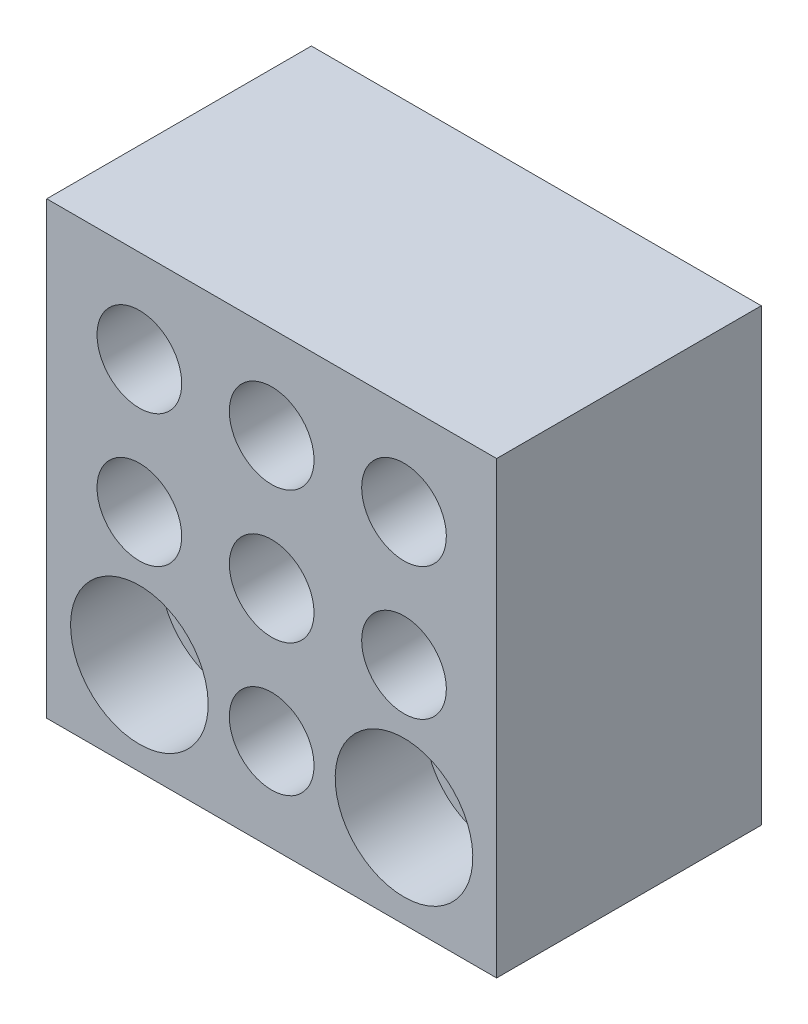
ISO-10303-21;
HEADER;
FILE_DESCRIPTION(('STEP AP214'),'2;1');
FILE_NAME('part.step','',(''),(''),'','','');
FILE_SCHEMA(('AUTOMOTIVE_DESIGN { 1 0 10303 214 1 1 1 1 }'));
ENDSEC;
DATA;
#1=APPLICATION_CONTEXT('core data for automotive mechanical design processes');
#2=APPLICATION_PROTOCOL_DEFINITION('international standard','automotive_design',2000,#1);
#3=PRODUCT_CONTEXT('',#1,'mechanical');
#4=PRODUCT('Part','Part','',(#3));
#5=PRODUCT_RELATED_PRODUCT_CATEGORY('part','',(#4));
#6=PRODUCT_DEFINITION_FORMATION('','',#4);
#7=PRODUCT_DEFINITION_CONTEXT('part definition',#1,'design');
#8=PRODUCT_DEFINITION('design','',#6,#7);
#9=PRODUCT_DEFINITION_SHAPE('','',#8);
#10=(LENGTH_UNIT() NAMED_UNIT(*) SI_UNIT(.MILLI.,.METRE.));
#11=(NAMED_UNIT(*) PLANE_ANGLE_UNIT() SI_UNIT($,.RADIAN.));
#12=(NAMED_UNIT(*) SI_UNIT($,.STERADIAN.) SOLID_ANGLE_UNIT());
#13=UNCERTAINTY_MEASURE_WITH_UNIT(LENGTH_MEASURE(1.E-05),#10,'distance_accuracy_value','');
#14=(GEOMETRIC_REPRESENTATION_CONTEXT(3) GLOBAL_UNCERTAINTY_ASSIGNED_CONTEXT((#13)) GLOBAL_UNIT_ASSIGNED_CONTEXT((#10,
#11,#12)) REPRESENTATION_CONTEXT('',''));
#15=CARTESIAN_POINT('',(0.,0.,0.));
#16=DIRECTION('',(0.,0.,1.));
#17=DIRECTION('',(1.,0.,0.));
#18=AXIS2_PLACEMENT_3D('',#15,#16,#17);
#19=CARTESIAN_POINT('',(25.,0.,50.));
#20=DIRECTION('',(0.,0.,-1.));
#21=DIRECTION('',(0.,1.,0.));
#22=AXIS2_PLACEMENT_3D('',#19,#20,#21);
#23=CYLINDRICAL_SURFACE('',#22,8.);
#24=CARTESIAN_POINT('',(25.,0.,50.));
#25=DIRECTION('',(0.,0.,1.));
#26=DIRECTION('',(0.,-1.,0.));
#27=AXIS2_PLACEMENT_3D('',#24,#25,#26);
#28=CIRCLE('',#27,8.);
#29=CARTESIAN_POINT('',(25.,-8.,50.));
#30=VERTEX_POINT('',#29);
#31=EDGE_CURVE('E72',#30,#30,#28,.T.);
#32=ORIENTED_EDGE('',*,*,#31,.T.);
#33=EDGE_LOOP('',(#32));
#34=FACE_BOUND('',#33,.T.);
#35=CARTESIAN_POINT('',(25.,0.,15.));
#36=DIRECTION('',(0.,0.,-1.));
#37=DIRECTION('',(-1.,0.,0.));
#38=AXIS2_PLACEMENT_3D('',#35,#36,#37);
#39=CIRCLE('',#38,8.);
#40=CARTESIAN_POINT('',(17.,0.,15.));
#41=VERTEX_POINT('',#40);
#42=EDGE_CURVE('E187',#41,#41,#39,.T.);
#43=ORIENTED_EDGE('',*,*,#42,.T.);
#44=EDGE_LOOP('',(#43));
#45=FACE_BOUND('',#44,.T.);
#46=ADVANCED_FACE('F14',(#34,#45),#23,.F.);
#47=CARTESIAN_POINT('',(0.,25.,50.));
#48=DIRECTION('',(0.,0.,-1.));
#49=DIRECTION('',(0.,1.,0.));
#50=AXIS2_PLACEMENT_3D('',#47,#48,#49);
#51=CYLINDRICAL_SURFACE('',#50,8.);
#52=CARTESIAN_POINT('',(0.,25.,50.));
#53=DIRECTION('',(0.,0.,1.));
#54=DIRECTION('',(0.,-1.,0.));
#55=AXIS2_PLACEMENT_3D('',#52,#53,#54);
#56=CIRCLE('',#55,8.);
#57=CARTESIAN_POINT('',(0.,17.,50.));
#58=VERTEX_POINT('',#57);
#59=EDGE_CURVE('E93',#58,#58,#56,.T.);
#60=ORIENTED_EDGE('',*,*,#59,.T.);
#61=EDGE_LOOP('',(#60));
#62=FACE_BOUND('',#61,.T.);
#63=CARTESIAN_POINT('',(0.,25.,15.));
#64=DIRECTION('',(0.,0.,-1.));
#65=DIRECTION('',(-1.,0.,0.));
#66=AXIS2_PLACEMENT_3D('',#63,#64,#65);
#67=CIRCLE('',#66,8.);
#68=CARTESIAN_POINT('',(-8.,25.,15.));
#69=VERTEX_POINT('',#68);
#70=EDGE_CURVE('E178',#69,#69,#67,.T.);
#71=ORIENTED_EDGE('',*,*,#70,.T.);
#72=EDGE_LOOP('',(#71));
#73=FACE_BOUND('',#72,.T.);
#74=ADVANCED_FACE('F223',(#62,#73),#51,.F.);
#75=CARTESIAN_POINT('',(25.,25.,50.));
#76=DIRECTION('',(0.,0.,-1.));
#77=DIRECTION('',(0.,1.,0.));
#78=AXIS2_PLACEMENT_3D('',#75,#76,#77);
#79=CYLINDRICAL_SURFACE('',#78,8.);
#80=CARTESIAN_POINT('',(25.,25.,50.));
#81=DIRECTION('',(0.,0.,1.));
#82=DIRECTION('',(0.,-1.,0.));
#83=AXIS2_PLACEMENT_3D('',#80,#81,#82);
#84=CIRCLE('',#83,8.);
#85=CARTESIAN_POINT('',(25.,17.,50.));
#86=VERTEX_POINT('',#85);
#87=EDGE_CURVE('E102',#86,#86,#84,.T.);
#88=ORIENTED_EDGE('',*,*,#87,.T.);
#89=EDGE_LOOP('',(#88));
#90=FACE_BOUND('',#89,.T.);
#91=CARTESIAN_POINT('',(25.,25.,15.));
#92=DIRECTION('',(0.,0.,-1.));
#93=DIRECTION('',(-1.,0.,0.));
#94=AXIS2_PLACEMENT_3D('',#91,#92,#93);
#95=CIRCLE('',#94,8.);
#96=CARTESIAN_POINT('',(17.,25.,15.));
#97=VERTEX_POINT('',#96);
#98=EDGE_CURVE('E169',#97,#97,#95,.T.);
#99=ORIENTED_EDGE('',*,*,#98,.T.);
#100=EDGE_LOOP('',(#99));
#101=FACE_BOUND('',#100,.T.);
#102=ADVANCED_FACE('F228',(#90,#101),#79,.F.);
#103=CARTESIAN_POINT('',(50.,25.,50.));
#104=DIRECTION('',(0.,0.,-1.));
#105=DIRECTION('',(0.,1.,0.));
#106=AXIS2_PLACEMENT_3D('',#103,#104,#105);
#107=CYLINDRICAL_SURFACE('',#106,8.);
#108=CARTESIAN_POINT('',(50.,25.,50.));
#109=DIRECTION('',(0.,0.,1.));
#110=DIRECTION('',(0.,-1.,0.));
#111=AXIS2_PLACEMENT_3D('',#108,#109,#110);
#112=CIRCLE('',#111,8.);
#113=CARTESIAN_POINT('',(50.,17.,50.));
#114=VERTEX_POINT('',#113);
#115=EDGE_CURVE('E108',#114,#114,#112,.T.);
#116=ORIENTED_EDGE('',*,*,#115,.T.);
#117=EDGE_LOOP('',(#116));
#118=FACE_BOUND('',#117,.T.);
#119=CARTESIAN_POINT('',(50.,25.,15.));
#120=DIRECTION('',(0.,0.,-1.));
#121=DIRECTION('',(-1.,0.,0.));
#122=AXIS2_PLACEMENT_3D('',#119,#120,#121);
#123=CIRCLE('',#122,8.);
#124=CARTESIAN_POINT('',(42.,25.,15.));
#125=VERTEX_POINT('',#124);
#126=EDGE_CURVE('E160',#125,#125,#123,.T.);
#127=ORIENTED_EDGE('',*,*,#126,.T.);
#128=EDGE_LOOP('',(#127));
#129=FACE_BOUND('',#128,.T.);
#130=ADVANCED_FACE('F243',(#118,#129),#107,.F.);
#131=CARTESIAN_POINT('',(50.,50.,50.));
#132=DIRECTION('',(0.,0.,-1.));
#133=DIRECTION('',(0.,1.,0.));
#134=AXIS2_PLACEMENT_3D('',#131,#132,#133);
#135=CYLINDRICAL_SURFACE('',#134,8.);
#136=CARTESIAN_POINT('',(50.,50.,50.));
#137=DIRECTION('',(0.,0.,1.));
#138=DIRECTION('',(0.,-1.,0.));
#139=AXIS2_PLACEMENT_3D('',#136,#137,#138);
#140=CIRCLE('',#139,8.);
#141=CARTESIAN_POINT('',(50.,42.,50.));
#142=VERTEX_POINT('',#141);
#143=EDGE_CURVE('E105',#142,#142,#140,.T.);
#144=ORIENTED_EDGE('',*,*,#143,.T.);
#145=EDGE_LOOP('',(#144));
#146=FACE_BOUND('',#145,.T.);
#147=CARTESIAN_POINT('',(50.,50.,15.));
#148=DIRECTION('',(0.,0.,-1.));
#149=DIRECTION('',(-1.,0.,0.));
#150=AXIS2_PLACEMENT_3D('',#147,#148,#149);
#151=CIRCLE('',#150,8.);
#152=CARTESIAN_POINT('',(42.,50.,15.));
#153=VERTEX_POINT('',#152);
#154=EDGE_CURVE('E151',#153,#153,#151,.T.);
#155=ORIENTED_EDGE('',*,*,#154,.T.);
#156=EDGE_LOOP('',(#155));
#157=FACE_BOUND('',#156,.T.);
#158=ADVANCED_FACE('F239',(#146,#157),#135,.F.);
#159=CARTESIAN_POINT('',(25.,50.,50.));
#160=DIRECTION('',(0.,0.,-1.));
#161=DIRECTION('',(0.,1.,0.));
#162=AXIS2_PLACEMENT_3D('',#159,#160,#161);
#163=CYLINDRICAL_SURFACE('',#162,8.);
#164=CARTESIAN_POINT('',(25.,50.,50.));
#165=DIRECTION('',(0.,0.,1.));
#166=DIRECTION('',(0.,-1.,0.));
#167=AXIS2_PLACEMENT_3D('',#164,#165,#166);
#168=CIRCLE('',#167,8.);
#169=CARTESIAN_POINT('',(25.,42.,50.));
#170=VERTEX_POINT('',#169);
#171=EDGE_CURVE('E99',#170,#170,#168,.T.);
#172=ORIENTED_EDGE('',*,*,#171,.T.);
#173=EDGE_LOOP('',(#172));
#174=FACE_BOUND('',#173,.T.);
#175=CARTESIAN_POINT('',(25.,50.,15.));
#176=DIRECTION('',(0.,0.,-1.));
#177=DIRECTION('',(-1.,0.,0.));
#178=AXIS2_PLACEMENT_3D('',#175,#176,#177);
#179=CIRCLE('',#178,8.);
#180=CARTESIAN_POINT('',(17.,50.,15.));
#181=VERTEX_POINT('',#180);
#182=EDGE_CURVE('E142',#181,#181,#179,.T.);
#183=ORIENTED_EDGE('',*,*,#182,.T.);
#184=EDGE_LOOP('',(#183));
#185=FACE_BOUND('',#184,.T.);
#186=ADVANCED_FACE('F235',(#174,#185),#163,.F.);
#187=CARTESIAN_POINT('',(0.,50.,50.));
#188=DIRECTION('',(0.,0.,-1.));
#189=DIRECTION('',(0.,1.,0.));
#190=AXIS2_PLACEMENT_3D('',#187,#188,#189);
#191=CYLINDRICAL_SURFACE('',#190,8.);
#192=CARTESIAN_POINT('',(0.,50.,50.));
#193=DIRECTION('',(0.,0.,1.));
#194=DIRECTION('',(0.,-1.,0.));
#195=AXIS2_PLACEMENT_3D('',#192,#193,#194);
#196=CIRCLE('',#195,8.);
#197=CARTESIAN_POINT('',(0.,42.,50.));
#198=VERTEX_POINT('',#197);
#199=EDGE_CURVE('E96',#198,#198,#196,.T.);
#200=ORIENTED_EDGE('',*,*,#199,.T.);
#201=EDGE_LOOP('',(#200));
#202=FACE_BOUND('',#201,.T.);
#203=CARTESIAN_POINT('',(0.,50.,15.));
#204=DIRECTION('',(0.,0.,-1.));
#205=DIRECTION('',(-1.,0.,0.));
#206=AXIS2_PLACEMENT_3D('',#203,#204,#205);
#207=CIRCLE('',#206,8.);
#208=CARTESIAN_POINT('',(-8.,50.,15.));
#209=VERTEX_POINT('',#208);
#210=EDGE_CURVE('E135',#209,#209,#207,.T.);
#211=ORIENTED_EDGE('',*,*,#210,.T.);
#212=EDGE_LOOP('',(#211));
#213=FACE_BOUND('',#212,.T.);
#214=ADVANCED_FACE('F218',(#202,#213),#191,.F.);
#215=CARTESIAN_POINT('',(-17.5,-17.5,50.));
#216=DIRECTION('',(0.,0.,-1.));
#217=DIRECTION('',(0.,1.,0.));
#218=AXIS2_PLACEMENT_3D('',#215,#216,#217);
#219=PLANE('',#218);
#220=CARTESIAN_POINT('',(50.,0.,50.));
#221=DIRECTION('',(0.,0.,1.));
#222=DIRECTION('',(0.,-1.,0.));
#223=AXIS2_PLACEMENT_3D('',#220,#221,#222);
#224=CIRCLE('',#223,13.);
#225=CARTESIAN_POINT('',(50.,-13.,50.));
#226=VERTEX_POINT('',#225);
#227=EDGE_CURVE('E120',#226,#226,#224,.T.);
#228=ORIENTED_EDGE('',*,*,#227,.F.);
#229=EDGE_LOOP('',(#228));
#230=FACE_BOUND('',#229,.T.);
#231=ORIENTED_EDGE('',*,*,#143,.F.);
#232=EDGE_LOOP('',(#231));
#233=FACE_BOUND('',#232,.T.);
#234=ORIENTED_EDGE('',*,*,#171,.F.);
#235=EDGE_LOOP('',(#234));
#236=FACE_BOUND('',#235,.T.);
#237=ORIENTED_EDGE('',*,*,#59,.F.);
#238=EDGE_LOOP('',(#237));
#239=FACE_BOUND('',#238,.T.);
#240=DIRECTION('',(-1.,0.,0.));
#241=VECTOR('',#240,1.);
#242=CARTESIAN_POINT('',(67.5,-17.5,50.));
#243=LINE('',#242,#241);
#244=CARTESIAN_POINT('',(67.5,-17.5,50.));
#245=VERTEX_POINT('',#244);
#246=CARTESIAN_POINT('',(-17.5,-17.5,50.));
#247=VERTEX_POINT('',#246);
#248=EDGE_CURVE('E56',#245,#247,#243,.T.);
#249=ORIENTED_EDGE('',*,*,#248,.F.);
#250=DIRECTION('',(0.,-1.,0.));
#251=VECTOR('',#250,1.);
#252=CARTESIAN_POINT('',(67.5,67.5,50.));
#253=LINE('',#252,#251);
#254=CARTESIAN_POINT('',(67.5,67.5,50.));
#255=VERTEX_POINT('',#254);
#256=EDGE_CURVE('E62',#255,#245,#253,.T.);
#257=ORIENTED_EDGE('',*,*,#256,.F.);
#258=DIRECTION('',(1.,0.,0.));
#259=VECTOR('',#258,1.);
#260=CARTESIAN_POINT('',(-17.5,67.5,50.));
#261=LINE('',#260,#259);
#262=CARTESIAN_POINT('',(-17.5,67.5,50.));
#263=VERTEX_POINT('',#262);
#264=EDGE_CURVE('E81',#263,#255,#261,.T.);
#265=ORIENTED_EDGE('',*,*,#264,.F.);
#266=DIRECTION('',(0.,1.,0.));
#267=VECTOR('',#266,1.);
#268=CARTESIAN_POINT('',(-17.5,-17.5,50.));
#269=LINE('',#268,#267);
#270=EDGE_CURVE('E83',#247,#263,#269,.T.);
#271=ORIENTED_EDGE('',*,*,#270,.F.);
#272=EDGE_LOOP('',(#249,#257,#265,#271));
#273=FACE_BOUND('',#272,.T.);
#274=ORIENTED_EDGE('',*,*,#31,.F.);
#275=EDGE_LOOP('',(#274));
#276=FACE_BOUND('',#275,.T.);
#277=ORIENTED_EDGE('',*,*,#199,.F.);
#278=EDGE_LOOP('',(#277));
#279=FACE_BOUND('',#278,.T.);
#280=ORIENTED_EDGE('',*,*,#87,.F.);
#281=EDGE_LOOP('',(#280));
#282=FACE_BOUND('',#281,.T.);
#283=ORIENTED_EDGE('',*,*,#115,.F.);
#284=EDGE_LOOP('',(#283));
#285=FACE_BOUND('',#284,.T.);
#286=CARTESIAN_POINT('',(0.,0.,50.));
#287=DIRECTION('',(0.,0.,1.));
#288=DIRECTION('',(0.,-1.,0.));
#289=AXIS2_PLACEMENT_3D('',#286,#287,#288);
#290=CIRCLE('',#289,13.);
#291=CARTESIAN_POINT('',(0.,-13.,50.));
#292=VERTEX_POINT('',#291);
#293=EDGE_CURVE('E132',#292,#292,#290,.T.);
#294=ORIENTED_EDGE('',*,*,#293,.F.);
#295=EDGE_LOOP('',(#294));
#296=FACE_BOUND('',#295,.T.);
#297=ADVANCED_FACE('F209',(#230,#233,#236,#239,#273,#276,#279,#282,#285,#296),#219,.F.);
#298=CARTESIAN_POINT('',(-17.5,-17.5,0.));
#299=DIRECTION('',(0.,0.,-1.));
#300=DIRECTION('',(0.,1.,0.));
#301=AXIS2_PLACEMENT_3D('',#298,#299,#300);
#302=PLANE('',#301);
#303=CARTESIAN_POINT('',(50.,0.,0.));
#304=DIRECTION('',(0.,0.,1.));
#305=DIRECTION('',(0.,-1.,0.));
#306=AXIS2_PLACEMENT_3D('',#303,#304,#305);
#307=CIRCLE('',#306,9.);
#308=CARTESIAN_POINT('',(50.,-9.,0.));
#309=VERTEX_POINT('',#308);
#310=EDGE_CURVE('E111',#309,#309,#307,.T.);
#311=ORIENTED_EDGE('',*,*,#310,.T.);
#312=EDGE_LOOP('',(#311));
#313=FACE_BOUND('',#312,.T.);
#314=DIRECTION('',(-1.,0.,0.));
#315=VECTOR('',#314,1.);
#316=CARTESIAN_POINT('',(67.5,-17.5,0.));
#317=LINE('',#316,#315);
#318=CARTESIAN_POINT('',(67.5,-17.5,0.));
#319=VERTEX_POINT('',#318);
#320=CARTESIAN_POINT('',(-17.5,-17.5,0.));
#321=VERTEX_POINT('',#320);
#322=EDGE_CURVE('E54',#319,#321,#317,.T.);
#323=ORIENTED_EDGE('',*,*,#322,.T.);
#324=DIRECTION('',(0.,1.,0.));
#325=VECTOR('',#324,1.);
#326=CARTESIAN_POINT('',(-17.5,-17.5,0.));
#327=LINE('',#326,#325);
#328=CARTESIAN_POINT('',(-17.5,67.5,0.));
#329=VERTEX_POINT('',#328);
#330=EDGE_CURVE('E69',#321,#329,#327,.T.);
#331=ORIENTED_EDGE('',*,*,#330,.T.);
#332=DIRECTION('',(1.,0.,0.));
#333=VECTOR('',#332,1.);
#334=CARTESIAN_POINT('',(-17.5,67.5,0.));
#335=LINE('',#334,#333);
#336=CARTESIAN_POINT('',(67.5,67.5,0.));
#337=VERTEX_POINT('',#336);
#338=EDGE_CURVE('E75',#329,#337,#335,.T.);
#339=ORIENTED_EDGE('',*,*,#338,.T.);
#340=DIRECTION('',(0.,-1.,0.));
#341=VECTOR('',#340,1.);
#342=CARTESIAN_POINT('',(67.5,67.5,0.));
#343=LINE('',#342,#341);
#344=EDGE_CURVE('E71',#337,#319,#343,.T.);
#345=ORIENTED_EDGE('',*,*,#344,.T.);
#346=EDGE_LOOP('',(#323,#331,#339,#345));
#347=FACE_BOUND('',#346,.T.);
#348=CARTESIAN_POINT('',(0.,0.,0.));
#349=DIRECTION('',(0.,0.,1.));
#350=DIRECTION('',(0.,-1.,0.));
#351=AXIS2_PLACEMENT_3D('',#348,#349,#350);
#352=CIRCLE('',#351,9.);
#353=CARTESIAN_POINT('',(0.,-9.,0.));
#354=VERTEX_POINT('',#353);
#355=EDGE_CURVE('E123',#354,#354,#352,.T.);
#356=ORIENTED_EDGE('',*,*,#355,.T.);
#357=EDGE_LOOP('',(#356));
#358=FACE_BOUND('',#357,.T.);
#359=CARTESIAN_POINT('',(0.,50.,0.));
#360=DIRECTION('',(0.,0.,-1.));
#361=DIRECTION('',(-1.,0.,0.));
#362=AXIS2_PLACEMENT_3D('',#359,#360,#361);
#363=CIRCLE('',#362,6.9);
#364=CARTESIAN_POINT('',(-6.9,50.,0.));
#365=VERTEX_POINT('',#364);
#366=EDGE_CURVE('E139',#365,#365,#363,.T.);
#367=ORIENTED_EDGE('',*,*,#366,.F.);
#368=EDGE_LOOP('',(#367));
#369=FACE_BOUND('',#368,.T.);
#370=CARTESIAN_POINT('',(25.,50.,0.));
#371=DIRECTION('',(0.,0.,-1.));
#372=DIRECTION('',(-1.,0.,0.));
#373=AXIS2_PLACEMENT_3D('',#370,#371,#372);
#374=CIRCLE('',#373,6.9);
#375=CARTESIAN_POINT('',(18.1,50.,0.));
#376=VERTEX_POINT('',#375);
#377=EDGE_CURVE('E148',#376,#376,#374,.T.);
#378=ORIENTED_EDGE('',*,*,#377,.F.);
#379=EDGE_LOOP('',(#378));
#380=FACE_BOUND('',#379,.T.);
#381=CARTESIAN_POINT('',(50.,50.,0.));
#382=DIRECTION('',(0.,0.,-1.));
#383=DIRECTION('',(-1.,0.,0.));
#384=AXIS2_PLACEMENT_3D('',#381,#382,#383);
#385=CIRCLE('',#384,6.9);
#386=CARTESIAN_POINT('',(43.1,50.,0.));
#387=VERTEX_POINT('',#386);
#388=EDGE_CURVE('E157',#387,#387,#385,.T.);
#389=ORIENTED_EDGE('',*,*,#388,.F.);
#390=EDGE_LOOP('',(#389));
#391=FACE_BOUND('',#390,.T.);
#392=CARTESIAN_POINT('',(50.,25.,0.));
#393=DIRECTION('',(0.,0.,-1.));
#394=DIRECTION('',(-1.,0.,0.));
#395=AXIS2_PLACEMENT_3D('',#392,#393,#394);
#396=CIRCLE('',#395,6.9);
#397=CARTESIAN_POINT('',(43.1,25.,0.));
#398=VERTEX_POINT('',#397);
#399=EDGE_CURVE('E166',#398,#398,#396,.T.);
#400=ORIENTED_EDGE('',*,*,#399,.F.);
#401=EDGE_LOOP('',(#400));
#402=FACE_BOUND('',#401,.T.);
#403=CARTESIAN_POINT('',(25.,25.,0.));
#404=DIRECTION('',(0.,0.,-1.));
#405=DIRECTION('',(-1.,0.,0.));
#406=AXIS2_PLACEMENT_3D('',#403,#404,#405);
#407=CIRCLE('',#406,6.9);
#408=CARTESIAN_POINT('',(18.1,25.,0.));
#409=VERTEX_POINT('',#408);
#410=EDGE_CURVE('E175',#409,#409,#407,.T.);
#411=ORIENTED_EDGE('',*,*,#410,.F.);
#412=EDGE_LOOP('',(#411));
#413=FACE_BOUND('',#412,.T.);
#414=CARTESIAN_POINT('',(0.,25.,0.));
#415=DIRECTION('',(0.,0.,-1.));
#416=DIRECTION('',(-1.,0.,0.));
#417=AXIS2_PLACEMENT_3D('',#414,#415,#416);
#418=CIRCLE('',#417,6.9);
#419=CARTESIAN_POINT('',(-6.9,25.,0.));
#420=VERTEX_POINT('',#419);
#421=EDGE_CURVE('E184',#420,#420,#418,.T.);
#422=ORIENTED_EDGE('',*,*,#421,.F.);
#423=EDGE_LOOP('',(#422));
#424=FACE_BOUND('',#423,.T.);
#425=CARTESIAN_POINT('',(25.,0.,0.));
#426=DIRECTION('',(0.,0.,-1.));
#427=DIRECTION('',(-1.,0.,0.));
#428=AXIS2_PLACEMENT_3D('',#425,#426,#427);
#429=CIRCLE('',#428,6.9);
#430=CARTESIAN_POINT('',(18.1,0.,0.));
#431=VERTEX_POINT('',#430);
#432=EDGE_CURVE('E193',#431,#431,#429,.T.);
#433=ORIENTED_EDGE('',*,*,#432,.F.);
#434=EDGE_LOOP('',(#433));
#435=FACE_BOUND('',#434,.T.);
#436=ADVANCED_FACE('F66',(#313,#347,#358,#369,#380,#391,#402,#413,#424,#435),#302,.T.);
#437=CARTESIAN_POINT('',(67.5,-17.5,50.));
#438=DIRECTION('',(0.,-1.,0.));
#439=DIRECTION('',(1.,0.,0.));
#440=AXIS2_PLACEMENT_3D('',#437,#438,#439);
#441=PLANE('',#440);
#442=DIRECTION('',(0.,0.,-1.));
#443=VECTOR('',#442,1.);
#444=CARTESIAN_POINT('',(67.5,-17.5,50.));
#445=LINE('',#444,#443);
#446=EDGE_CURVE('E9',#245,#319,#445,.T.);
#447=ORIENTED_EDGE('',*,*,#446,.F.);
#448=ORIENTED_EDGE('',*,*,#248,.T.);
#449=DIRECTION('',(0.,0.,-1.));
#450=VECTOR('',#449,1.);
#451=CARTESIAN_POINT('',(-17.5,-17.5,50.));
#452=LINE('',#451,#450);
#453=EDGE_CURVE('E51',#247,#321,#452,.T.);
#454=ORIENTED_EDGE('',*,*,#453,.T.);
#455=ORIENTED_EDGE('',*,*,#322,.F.);
#456=EDGE_LOOP('',(#447,#448,#454,#455));
#457=FACE_BOUND('',#456,.T.);
#458=ADVANCED_FACE('F53',(#457),#441,.T.);
#459=CARTESIAN_POINT('',(67.5,67.5,50.));
#460=DIRECTION('',(1.,0.,0.));
#461=DIRECTION('',(0.,1.,0.));
#462=AXIS2_PLACEMENT_3D('',#459,#460,#461);
#463=PLANE('',#462);
#464=DIRECTION('',(0.,0.,-1.));
#465=VECTOR('',#464,1.);
#466=CARTESIAN_POINT('',(67.5,67.5,50.));
#467=LINE('',#466,#465);
#468=EDGE_CURVE('E22',#255,#337,#467,.T.);
#469=ORIENTED_EDGE('',*,*,#468,.F.);
#470=ORIENTED_EDGE('',*,*,#256,.T.);
#471=ORIENTED_EDGE('',*,*,#446,.T.);
#472=ORIENTED_EDGE('',*,*,#344,.F.);
#473=EDGE_LOOP('',(#469,#470,#471,#472));
#474=FACE_BOUND('',#473,.T.);
#475=ADVANCED_FACE('F16',(#474),#463,.T.);
#476=CARTESIAN_POINT('',(-17.5,67.5,50.));
#477=DIRECTION('',(0.,1.,0.));
#478=DIRECTION('',(-1.,0.,0.));
#479=AXIS2_PLACEMENT_3D('',#476,#477,#478);
#480=PLANE('',#479);
#481=DIRECTION('',(0.,0.,-1.));
#482=VECTOR('',#481,1.);
#483=CARTESIAN_POINT('',(-17.5,67.5,50.));
#484=LINE('',#483,#482);
#485=EDGE_CURVE('E61',#263,#329,#484,.T.);
#486=ORIENTED_EDGE('',*,*,#485,.F.);
#487=ORIENTED_EDGE('',*,*,#264,.T.);
#488=ORIENTED_EDGE('',*,*,#468,.T.);
#489=ORIENTED_EDGE('',*,*,#338,.F.);
#490=EDGE_LOOP('',(#486,#487,#488,#489));
#491=FACE_BOUND('',#490,.T.);
#492=ADVANCED_FACE('F87',(#491),#480,.T.);
#493=CARTESIAN_POINT('',(-17.5,-17.5,50.));
#494=DIRECTION('',(-1.,0.,0.));
#495=DIRECTION('',(0.,-1.,0.));
#496=AXIS2_PLACEMENT_3D('',#493,#494,#495);
#497=PLANE('',#496);
#498=ORIENTED_EDGE('',*,*,#270,.T.);
#499=ORIENTED_EDGE('',*,*,#485,.T.);
#500=ORIENTED_EDGE('',*,*,#330,.F.);
#501=ORIENTED_EDGE('',*,*,#453,.F.);
#502=EDGE_LOOP('',(#498,#499,#500,#501));
#503=FACE_BOUND('',#502,.T.);
#504=ADVANCED_FACE('F74',(#503),#497,.T.);
#505=CARTESIAN_POINT('',(50.,0.,50.));
#506=DIRECTION('',(0.,0.,1.));
#507=DIRECTION('',(0.,-1.,0.));
#508=AXIS2_PLACEMENT_3D('',#505,#506,#507);
#509=CYLINDRICAL_SURFACE('',#508,9.);
#510=CARTESIAN_POINT('',(50.,0.,33.));
#511=DIRECTION('',(0.,0.,1.));
#512=DIRECTION('',(0.,-1.,0.));
#513=AXIS2_PLACEMENT_3D('',#510,#511,#512);
#514=CIRCLE('',#513,9.);
#515=CARTESIAN_POINT('',(50.,-9.,33.));
#516=VERTEX_POINT('',#515);
#517=EDGE_CURVE('E114',#516,#516,#514,.T.);
#518=ORIENTED_EDGE('',*,*,#517,.T.);
#519=EDGE_LOOP('',(#518));
#520=FACE_BOUND('',#519,.T.);
#521=ORIENTED_EDGE('',*,*,#310,.F.);
#522=EDGE_LOOP('',(#521));
#523=FACE_BOUND('',#522,.T.);
#524=ADVANCED_FACE('F251',(#520,#523),#509,.F.);
#525=CARTESIAN_POINT('',(50.,-9.,33.));
#526=DIRECTION('',(0.,0.,1.));
#527=DIRECTION('',(0.,-1.,0.));
#528=AXIS2_PLACEMENT_3D('',#525,#526,#527);
#529=PLANE('',#528);
#530=CARTESIAN_POINT('',(50.,0.,33.));
#531=DIRECTION('',(0.,0.,1.));
#532=DIRECTION('',(0.,-1.,0.));
#533=AXIS2_PLACEMENT_3D('',#530,#531,#532);
#534=CIRCLE('',#533,13.);
#535=CARTESIAN_POINT('',(50.,-13.,33.));
#536=VERTEX_POINT('',#535);
#537=EDGE_CURVE('E117',#536,#536,#534,.T.);
#538=ORIENTED_EDGE('',*,*,#537,.T.);
#539=EDGE_LOOP('',(#538));
#540=FACE_BOUND('',#539,.T.);
#541=ORIENTED_EDGE('',*,*,#517,.F.);
#542=EDGE_LOOP('',(#541));
#543=FACE_BOUND('',#542,.T.);
#544=ADVANCED_FACE('F254',(#540,#543),#529,.T.);
#545=CARTESIAN_POINT('',(50.,0.,50.));
#546=DIRECTION('',(0.,0.,1.));
#547=DIRECTION('',(0.,-1.,0.));
#548=AXIS2_PLACEMENT_3D('',#545,#546,#547);
#549=CYLINDRICAL_SURFACE('',#548,13.);
#550=ORIENTED_EDGE('',*,*,#227,.T.);
#551=EDGE_LOOP('',(#550));
#552=FACE_BOUND('',#551,.T.);
#553=ORIENTED_EDGE('',*,*,#537,.F.);
#554=EDGE_LOOP('',(#553));
#555=FACE_BOUND('',#554,.T.);
#556=ADVANCED_FACE('F258',(#552,#555),#549,.F.);
#557=CARTESIAN_POINT('',(0.,0.,50.));
#558=DIRECTION('',(0.,0.,1.));
#559=DIRECTION('',(0.,-1.,0.));
#560=AXIS2_PLACEMENT_3D('',#557,#558,#559);
#561=CYLINDRICAL_SURFACE('',#560,9.);
#562=CARTESIAN_POINT('',(0.,0.,33.));
#563=DIRECTION('',(0.,0.,1.));
#564=DIRECTION('',(0.,-1.,0.));
#565=AXIS2_PLACEMENT_3D('',#562,#563,#564);
#566=CIRCLE('',#565,9.);
#567=CARTESIAN_POINT('',(0.,-9.,33.));
#568=VERTEX_POINT('',#567);
#569=EDGE_CURVE('E126',#568,#568,#566,.T.);
#570=ORIENTED_EDGE('',*,*,#569,.T.);
#571=EDGE_LOOP('',(#570));
#572=FACE_BOUND('',#571,.T.);
#573=ORIENTED_EDGE('',*,*,#355,.F.);
#574=EDGE_LOOP('',(#573));
#575=FACE_BOUND('',#574,.T.);
#576=ADVANCED_FACE('F262',(#572,#575),#561,.F.);
#577=CARTESIAN_POINT('',(0.,-9.,33.));
#578=DIRECTION('',(0.,0.,1.));
#579=DIRECTION('',(0.,-1.,0.));
#580=AXIS2_PLACEMENT_3D('',#577,#578,#579);
#581=PLANE('',#580);
#582=CARTESIAN_POINT('',(0.,0.,33.));
#583=DIRECTION('',(0.,0.,1.));
#584=DIRECTION('',(0.,-1.,0.));
#585=AXIS2_PLACEMENT_3D('',#582,#583,#584);
#586=CIRCLE('',#585,13.);
#587=CARTESIAN_POINT('',(0.,-13.,33.));
#588=VERTEX_POINT('',#587);
#589=EDGE_CURVE('E129',#588,#588,#586,.T.);
#590=ORIENTED_EDGE('',*,*,#589,.T.);
#591=EDGE_LOOP('',(#590));
#592=FACE_BOUND('',#591,.T.);
#593=ORIENTED_EDGE('',*,*,#569,.F.);
#594=EDGE_LOOP('',(#593));
#595=FACE_BOUND('',#594,.T.);
#596=ADVANCED_FACE('F266',(#592,#595),#581,.T.);
#597=CARTESIAN_POINT('',(0.,0.,50.));
#598=DIRECTION('',(0.,0.,1.));
#599=DIRECTION('',(0.,-1.,0.));
#600=AXIS2_PLACEMENT_3D('',#597,#598,#599);
#601=CYLINDRICAL_SURFACE('',#600,13.);
#602=ORIENTED_EDGE('',*,*,#293,.T.);
#603=EDGE_LOOP('',(#602));
#604=FACE_BOUND('',#603,.T.);
#605=ORIENTED_EDGE('',*,*,#589,.F.);
#606=EDGE_LOOP('',(#605));
#607=FACE_BOUND('',#606,.T.);
#608=ADVANCED_FACE('F270',(#604,#607),#601,.F.);
#609=CARTESIAN_POINT('',(0.,50.,15.));
#610=DIRECTION('',(0.,0.,-1.));
#611=DIRECTION('',(-1.,0.,0.));
#612=AXIS2_PLACEMENT_3D('',#609,#610,#611);
#613=PLANE('',#612);
#614=CARTESIAN_POINT('',(0.,50.,15.));
#615=DIRECTION('',(0.,0.,-1.));
#616=DIRECTION('',(-1.,0.,0.));
#617=AXIS2_PLACEMENT_3D('',#614,#615,#616);
#618=CIRCLE('',#617,6.9);
#619=CARTESIAN_POINT('',(-6.9,50.,15.));
#620=VERTEX_POINT('',#619);
#621=EDGE_CURVE('E138',#620,#620,#618,.T.);
#622=ORIENTED_EDGE('',*,*,#621,.T.);
#623=EDGE_LOOP('',(#622));
#624=FACE_BOUND('',#623,.T.);
#625=ORIENTED_EDGE('',*,*,#210,.F.);
#626=EDGE_LOOP('',(#625));
#627=FACE_BOUND('',#626,.T.);
#628=ADVANCED_FACE('F274',(#624,#627),#613,.F.);
#629=CARTESIAN_POINT('',(0.,50.,15.));
#630=DIRECTION('',(0.,0.,-1.));
#631=DIRECTION('',(-1.,0.,0.));
#632=AXIS2_PLACEMENT_3D('',#629,#630,#631);
#633=CYLINDRICAL_SURFACE('',#632,6.9);
#634=ORIENTED_EDGE('',*,*,#621,.F.);
#635=EDGE_LOOP('',(#634));
#636=FACE_BOUND('',#635,.T.);
#637=ORIENTED_EDGE('',*,*,#366,.T.);
#638=EDGE_LOOP('',(#637));
#639=FACE_BOUND('',#638,.T.);
#640=ADVANCED_FACE('F278',(#636,#639),#633,.F.);
#641=CARTESIAN_POINT('',(25.,50.,15.));
#642=DIRECTION('',(0.,0.,-1.));
#643=DIRECTION('',(-1.,0.,0.));
#644=AXIS2_PLACEMENT_3D('',#641,#642,#643);
#645=PLANE('',#644);
#646=CARTESIAN_POINT('',(25.,50.,15.));
#647=DIRECTION('',(0.,0.,-1.));
#648=DIRECTION('',(-1.,0.,0.));
#649=AXIS2_PLACEMENT_3D('',#646,#647,#648);
#650=CIRCLE('',#649,6.9);
#651=CARTESIAN_POINT('',(18.1,50.,15.));
#652=VERTEX_POINT('',#651);
#653=EDGE_CURVE('E147',#652,#652,#650,.T.);
#654=ORIENTED_EDGE('',*,*,#653,.T.);
#655=EDGE_LOOP('',(#654));
#656=FACE_BOUND('',#655,.T.);
#657=ORIENTED_EDGE('',*,*,#182,.F.);
#658=EDGE_LOOP('',(#657));
#659=FACE_BOUND('',#658,.T.);
#660=ADVANCED_FACE('F282',(#656,#659),#645,.F.);
#661=CARTESIAN_POINT('',(25.,50.,15.));
#662=DIRECTION('',(0.,0.,-1.));
#663=DIRECTION('',(-1.,0.,0.));
#664=AXIS2_PLACEMENT_3D('',#661,#662,#663);
#665=CYLINDRICAL_SURFACE('',#664,6.9);
#666=ORIENTED_EDGE('',*,*,#653,.F.);
#667=EDGE_LOOP('',(#666));
#668=FACE_BOUND('',#667,.T.);
#669=ORIENTED_EDGE('',*,*,#377,.T.);
#670=EDGE_LOOP('',(#669));
#671=FACE_BOUND('',#670,.T.);
#672=ADVANCED_FACE('F286',(#668,#671),#665,.F.);
#673=CARTESIAN_POINT('',(50.,50.,15.));
#674=DIRECTION('',(0.,0.,-1.));
#675=DIRECTION('',(-1.,0.,0.));
#676=AXIS2_PLACEMENT_3D('',#673,#674,#675);
#677=PLANE('',#676);
#678=CARTESIAN_POINT('',(50.,50.,15.));
#679=DIRECTION('',(0.,0.,-1.));
#680=DIRECTION('',(-1.,0.,0.));
#681=AXIS2_PLACEMENT_3D('',#678,#679,#680);
#682=CIRCLE('',#681,6.9);
#683=CARTESIAN_POINT('',(43.1,50.,15.));
#684=VERTEX_POINT('',#683);
#685=EDGE_CURVE('E156',#684,#684,#682,.T.);
#686=ORIENTED_EDGE('',*,*,#685,.T.);
#687=EDGE_LOOP('',(#686));
#688=FACE_BOUND('',#687,.T.);
#689=ORIENTED_EDGE('',*,*,#154,.F.);
#690=EDGE_LOOP('',(#689));
#691=FACE_BOUND('',#690,.T.);
#692=ADVANCED_FACE('F290',(#688,#691),#677,.F.);
#693=CARTESIAN_POINT('',(50.,50.,15.));
#694=DIRECTION('',(0.,0.,-1.));
#695=DIRECTION('',(-1.,0.,0.));
#696=AXIS2_PLACEMENT_3D('',#693,#694,#695);
#697=CYLINDRICAL_SURFACE('',#696,6.9);
#698=ORIENTED_EDGE('',*,*,#685,.F.);
#699=EDGE_LOOP('',(#698));
#700=FACE_BOUND('',#699,.T.);
#701=ORIENTED_EDGE('',*,*,#388,.T.);
#702=EDGE_LOOP('',(#701));
#703=FACE_BOUND('',#702,.T.);
#704=ADVANCED_FACE('F294',(#700,#703),#697,.F.);
#705=CARTESIAN_POINT('',(50.,25.,15.));
#706=DIRECTION('',(0.,0.,-1.));
#707=DIRECTION('',(-1.,0.,0.));
#708=AXIS2_PLACEMENT_3D('',#705,#706,#707);
#709=PLANE('',#708);
#710=CARTESIAN_POINT('',(50.,25.,15.));
#711=DIRECTION('',(0.,0.,-1.));
#712=DIRECTION('',(-1.,0.,0.));
#713=AXIS2_PLACEMENT_3D('',#710,#711,#712);
#714=CIRCLE('',#713,6.9);
#715=CARTESIAN_POINT('',(43.1,25.,15.));
#716=VERTEX_POINT('',#715);
#717=EDGE_CURVE('E165',#716,#716,#714,.T.);
#718=ORIENTED_EDGE('',*,*,#717,.T.);
#719=EDGE_LOOP('',(#718));
#720=FACE_BOUND('',#719,.T.);
#721=ORIENTED_EDGE('',*,*,#126,.F.);
#722=EDGE_LOOP('',(#721));
#723=FACE_BOUND('',#722,.T.);
#724=ADVANCED_FACE('F298',(#720,#723),#709,.F.);
#725=CARTESIAN_POINT('',(50.,25.,15.));
#726=DIRECTION('',(0.,0.,-1.));
#727=DIRECTION('',(-1.,0.,0.));
#728=AXIS2_PLACEMENT_3D('',#725,#726,#727);
#729=CYLINDRICAL_SURFACE('',#728,6.9);
#730=ORIENTED_EDGE('',*,*,#717,.F.);
#731=EDGE_LOOP('',(#730));
#732=FACE_BOUND('',#731,.T.);
#733=ORIENTED_EDGE('',*,*,#399,.T.);
#734=EDGE_LOOP('',(#733));
#735=FACE_BOUND('',#734,.T.);
#736=ADVANCED_FACE('F302',(#732,#735),#729,.F.);
#737=CARTESIAN_POINT('',(25.,25.,15.));
#738=DIRECTION('',(0.,0.,-1.));
#739=DIRECTION('',(-1.,0.,0.));
#740=AXIS2_PLACEMENT_3D('',#737,#738,#739);
#741=PLANE('',#740);
#742=CARTESIAN_POINT('',(25.,25.,15.));
#743=DIRECTION('',(0.,0.,-1.));
#744=DIRECTION('',(-1.,0.,0.));
#745=AXIS2_PLACEMENT_3D('',#742,#743,#744);
#746=CIRCLE('',#745,6.9);
#747=CARTESIAN_POINT('',(18.1,25.,15.));
#748=VERTEX_POINT('',#747);
#749=EDGE_CURVE('E174',#748,#748,#746,.T.);
#750=ORIENTED_EDGE('',*,*,#749,.T.);
#751=EDGE_LOOP('',(#750));
#752=FACE_BOUND('',#751,.T.);
#753=ORIENTED_EDGE('',*,*,#98,.F.);
#754=EDGE_LOOP('',(#753));
#755=FACE_BOUND('',#754,.T.);
#756=ADVANCED_FACE('F306',(#752,#755),#741,.F.);
#757=CARTESIAN_POINT('',(25.,25.,15.));
#758=DIRECTION('',(0.,0.,-1.));
#759=DIRECTION('',(-1.,0.,0.));
#760=AXIS2_PLACEMENT_3D('',#757,#758,#759);
#761=CYLINDRICAL_SURFACE('',#760,6.9);
#762=ORIENTED_EDGE('',*,*,#749,.F.);
#763=EDGE_LOOP('',(#762));
#764=FACE_BOUND('',#763,.T.);
#765=ORIENTED_EDGE('',*,*,#410,.T.);
#766=EDGE_LOOP('',(#765));
#767=FACE_BOUND('',#766,.T.);
#768=ADVANCED_FACE('F310',(#764,#767),#761,.F.);
#769=CARTESIAN_POINT('',(0.,25.,15.));
#770=DIRECTION('',(0.,0.,-1.));
#771=DIRECTION('',(-1.,0.,0.));
#772=AXIS2_PLACEMENT_3D('',#769,#770,#771);
#773=PLANE('',#772);
#774=CARTESIAN_POINT('',(0.,25.,15.));
#775=DIRECTION('',(0.,0.,-1.));
#776=DIRECTION('',(-1.,0.,0.));
#777=AXIS2_PLACEMENT_3D('',#774,#775,#776);
#778=CIRCLE('',#777,6.9);
#779=CARTESIAN_POINT('',(-6.9,25.,15.));
#780=VERTEX_POINT('',#779);
#781=EDGE_CURVE('E183',#780,#780,#778,.T.);
#782=ORIENTED_EDGE('',*,*,#781,.T.);
#783=EDGE_LOOP('',(#782));
#784=FACE_BOUND('',#783,.T.);
#785=ORIENTED_EDGE('',*,*,#70,.F.);
#786=EDGE_LOOP('',(#785));
#787=FACE_BOUND('',#786,.T.);
#788=ADVANCED_FACE('F314',(#784,#787),#773,.F.);
#789=CARTESIAN_POINT('',(0.,25.,15.));
#790=DIRECTION('',(0.,0.,-1.));
#791=DIRECTION('',(-1.,0.,0.));
#792=AXIS2_PLACEMENT_3D('',#789,#790,#791);
#793=CYLINDRICAL_SURFACE('',#792,6.9);
#794=ORIENTED_EDGE('',*,*,#781,.F.);
#795=EDGE_LOOP('',(#794));
#796=FACE_BOUND('',#795,.T.);
#797=ORIENTED_EDGE('',*,*,#421,.T.);
#798=EDGE_LOOP('',(#797));
#799=FACE_BOUND('',#798,.T.);
#800=ADVANCED_FACE('F318',(#796,#799),#793,.F.);
#801=CARTESIAN_POINT('',(25.,0.,15.));
#802=DIRECTION('',(0.,0.,-1.));
#803=DIRECTION('',(-1.,0.,0.));
#804=AXIS2_PLACEMENT_3D('',#801,#802,#803);
#805=PLANE('',#804);
#806=CARTESIAN_POINT('',(25.,0.,15.));
#807=DIRECTION('',(0.,0.,-1.));
#808=DIRECTION('',(-1.,0.,0.));
#809=AXIS2_PLACEMENT_3D('',#806,#807,#808);
#810=CIRCLE('',#809,6.9);
#811=CARTESIAN_POINT('',(18.1,0.,15.));
#812=VERTEX_POINT('',#811);
#813=EDGE_CURVE('E192',#812,#812,#810,.T.);
#814=ORIENTED_EDGE('',*,*,#813,.T.);
#815=EDGE_LOOP('',(#814));
#816=FACE_BOUND('',#815,.T.);
#817=ORIENTED_EDGE('',*,*,#42,.F.);
#818=EDGE_LOOP('',(#817));
#819=FACE_BOUND('',#818,.T.);
#820=ADVANCED_FACE('F199',(#816,#819),#805,.F.);
#821=CARTESIAN_POINT('',(25.,0.,15.));
#822=DIRECTION('',(0.,0.,-1.));
#823=DIRECTION('',(-1.,0.,0.));
#824=AXIS2_PLACEMENT_3D('',#821,#822,#823);
#825=CYLINDRICAL_SURFACE('',#824,6.9);
#826=ORIENTED_EDGE('',*,*,#813,.F.);
#827=EDGE_LOOP('',(#826));
#828=FACE_BOUND('',#827,.T.);
#829=ORIENTED_EDGE('',*,*,#432,.T.);
#830=EDGE_LOOP('',(#829));
#831=FACE_BOUND('',#830,.T.);
#832=ADVANCED_FACE('F202',(#828,#831),#825,.F.);
#833=CLOSED_SHELL('',(#46,#74,#102,#130,#158,#186,#214,#297,#436,#458,#475,#492,#504,#524,#544,
#556,#576,#596,#608,#628,#640,#660,#672,#692,#704,#724,#736,#756,#768,#788,#800,#820,#832));
#834=MANIFOLD_SOLID_BREP('B1',#833);
#835=ADVANCED_BREP_SHAPE_REPRESENTATION('',(#18,#834),#14);
#836=SHAPE_DEFINITION_REPRESENTATION(#9,#835);
ENDSEC;
END-ISO-10303-21;
